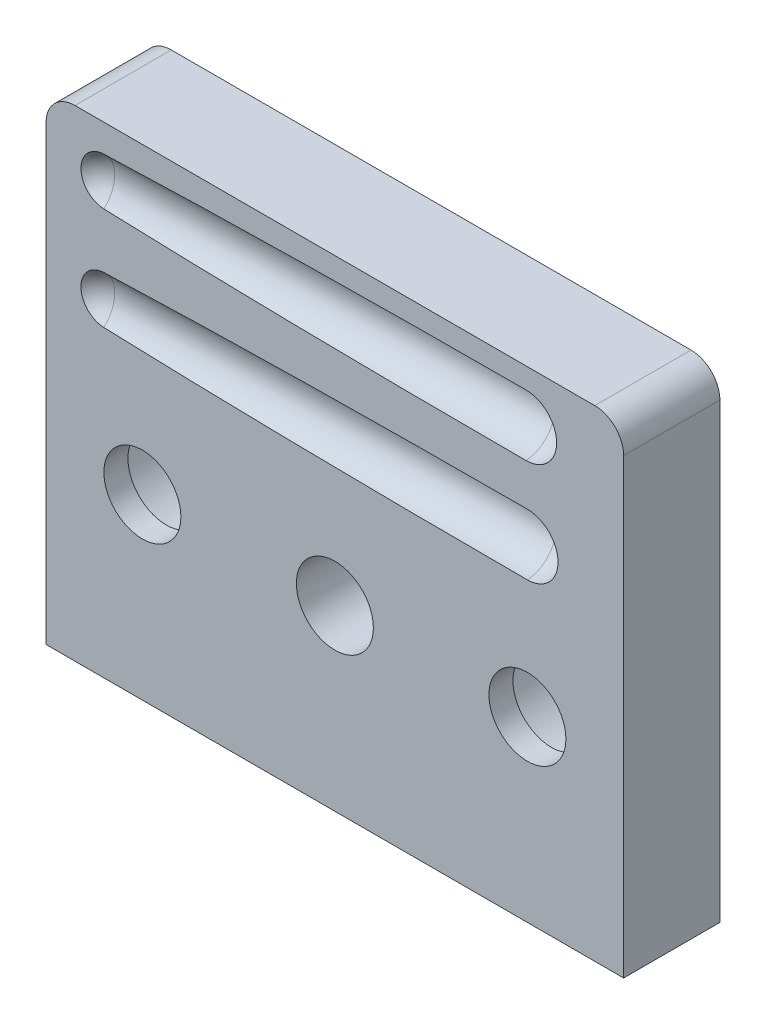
ISO-10303-21;
HEADER;
FILE_DESCRIPTION(('STEP AP214'),'2;1');
FILE_NAME('part.step','',(''),(''),'','','');
FILE_SCHEMA(('AUTOMOTIVE_DESIGN { 1 0 10303 214 1 1 1 1 }'));
ENDSEC;
DATA;
#1=APPLICATION_CONTEXT('core data for automotive mechanical design processes');
#2=APPLICATION_PROTOCOL_DEFINITION('international standard','automotive_design',2000,#1);
#3=PRODUCT_CONTEXT('',#1,'mechanical');
#4=PRODUCT('Part','Part','',(#3));
#5=PRODUCT_RELATED_PRODUCT_CATEGORY('part','',(#4));
#6=PRODUCT_DEFINITION_FORMATION('','',#4);
#7=PRODUCT_DEFINITION_CONTEXT('part definition',#1,'design');
#8=PRODUCT_DEFINITION('design','',#6,#7);
#9=PRODUCT_DEFINITION_SHAPE('','',#8);
#10=(LENGTH_UNIT() NAMED_UNIT(*) SI_UNIT(.MILLI.,.METRE.));
#11=(NAMED_UNIT(*) PLANE_ANGLE_UNIT() SI_UNIT($,.RADIAN.));
#12=(NAMED_UNIT(*) SI_UNIT($,.STERADIAN.) SOLID_ANGLE_UNIT());
#13=UNCERTAINTY_MEASURE_WITH_UNIT(LENGTH_MEASURE(1.E-05),#10,'distance_accuracy_value','');
#14=(GEOMETRIC_REPRESENTATION_CONTEXT(3) GLOBAL_UNCERTAINTY_ASSIGNED_CONTEXT((#13)) GLOBAL_UNIT_ASSIGNED_CONTEXT((#10,
#11,#12)) REPRESENTATION_CONTEXT('',''));
#15=CARTESIAN_POINT('',(0.,0.,0.));
#16=DIRECTION('',(0.,0.,1.));
#17=DIRECTION('',(1.,0.,0.));
#18=AXIS2_PLACEMENT_3D('',#15,#16,#17);
#19=CARTESIAN_POINT('',(0.,0.,0.));
#20=DIRECTION('',(0.,0.,1.));
#21=DIRECTION('',(1.,0.,0.));
#22=AXIS2_PLACEMENT_3D('',#19,#20,#21);
#23=CYLINDRICAL_SURFACE('',#22,4.);
#24=CARTESIAN_POINT('',(0.,0.,10.));
#25=DIRECTION('',(0.,0.,1.));
#26=DIRECTION('',(1.,0.,0.));
#27=AXIS2_PLACEMENT_3D('',#24,#25,#26);
#28=CIRCLE('',#27,4.);
#29=CARTESIAN_POINT('',(4.00000000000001,0.,10.));
#30=VERTEX_POINT('',#29);
#31=EDGE_CURVE('E154',#30,#30,#28,.T.);
#32=ORIENTED_EDGE('',*,*,#31,.T.);
#33=EDGE_LOOP('',(#32));
#34=FACE_BOUND('',#33,.T.);
#35=CARTESIAN_POINT('',(0.,0.,4.));
#36=DIRECTION('',(0.,0.,-1.));
#37=DIRECTION('',(-1.,0.,0.));
#38=AXIS2_PLACEMENT_3D('',#35,#36,#37);
#39=CIRCLE('',#38,4.);
#40=CARTESIAN_POINT('',(-3.99999999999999,0.,4.));
#41=VERTEX_POINT('',#40);
#42=EDGE_CURVE('E33',#41,#41,#39,.F.);
#43=ORIENTED_EDGE('',*,*,#42,.F.);
#44=EDGE_LOOP('',(#43));
#45=FACE_BOUND('',#44,.T.);
#46=ADVANCED_FACE('F29',(#34,#45),#23,.F.);
#47=CARTESIAN_POINT('',(-20.,0.,0.));
#48=DIRECTION('',(0.,0.,1.));
#49=DIRECTION('',(1.,0.,0.));
#50=AXIS2_PLACEMENT_3D('',#47,#48,#49);
#51=CYLINDRICAL_SURFACE('',#50,4.);
#52=CARTESIAN_POINT('',(-20.,0.,10.));
#53=DIRECTION('',(0.,0.,1.));
#54=DIRECTION('',(1.,0.,0.));
#55=AXIS2_PLACEMENT_3D('',#52,#53,#54);
#56=CIRCLE('',#55,4.);
#57=CARTESIAN_POINT('',(-16.,0.,10.));
#58=VERTEX_POINT('',#57);
#59=EDGE_CURVE('E157',#58,#58,#56,.T.);
#60=ORIENTED_EDGE('',*,*,#59,.T.);
#61=EDGE_LOOP('',(#60));
#62=FACE_BOUND('',#61,.T.);
#63=CARTESIAN_POINT('',(-20.,0.,7.5));
#64=DIRECTION('',(0.,0.,-1.));
#65=DIRECTION('',(-1.,0.,0.));
#66=AXIS2_PLACEMENT_3D('',#63,#64,#65);
#67=CIRCLE('',#66,4.);
#68=CARTESIAN_POINT('',(-24.,0.,7.5));
#69=VERTEX_POINT('',#68);
#70=EDGE_CURVE('E127',#69,#69,#67,.F.);
#71=ORIENTED_EDGE('',*,*,#70,.F.);
#72=EDGE_LOOP('',(#71));
#73=FACE_BOUND('',#72,.T.);
#74=ADVANCED_FACE('F235',(#62,#73),#51,.F.);
#75=CARTESIAN_POINT('',(20.,0.,0.));
#76=DIRECTION('',(0.,0.,1.));
#77=DIRECTION('',(1.,0.,0.));
#78=AXIS2_PLACEMENT_3D('',#75,#76,#77);
#79=CYLINDRICAL_SURFACE('',#78,4.);
#80=CARTESIAN_POINT('',(20.,0.,10.));
#81=DIRECTION('',(0.,0.,1.));
#82=DIRECTION('',(1.,0.,0.));
#83=AXIS2_PLACEMENT_3D('',#80,#81,#82);
#84=CIRCLE('',#83,4.);
#85=CARTESIAN_POINT('',(24.,0.,10.));
#86=VERTEX_POINT('',#85);
#87=EDGE_CURVE('E151',#86,#86,#84,.T.);
#88=ORIENTED_EDGE('',*,*,#87,.T.);
#89=EDGE_LOOP('',(#88));
#90=FACE_BOUND('',#89,.T.);
#91=CARTESIAN_POINT('',(20.,0.,7.5));
#92=DIRECTION('',(0.,0.,-1.));
#93=DIRECTION('',(-1.,0.,0.));
#94=AXIS2_PLACEMENT_3D('',#91,#92,#93);
#95=CIRCLE('',#94,4.);
#96=CARTESIAN_POINT('',(16.,0.,7.5));
#97=VERTEX_POINT('',#96);
#98=EDGE_CURVE('E124',#97,#97,#95,.F.);
#99=ORIENTED_EDGE('',*,*,#98,.F.);
#100=EDGE_LOOP('',(#99));
#101=FACE_BOUND('',#100,.T.);
#102=ADVANCED_FACE('F241',(#90,#101),#79,.F.);
#103=CARTESIAN_POINT('',(-30.,-18.5,10.));
#104=DIRECTION('',(0.,0.,-1.));
#105=DIRECTION('',(-1.,0.,0.));
#106=AXIS2_PLACEMENT_3D('',#103,#104,#105);
#107=PLANE('',#106);
#108=CARTESIAN_POINT('',(-23.9094567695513,15.5,10.));
#109=DIRECTION('',(0.,0.,-1.));
#110=DIRECTION('',(-1.,0.,0.));
#111=AXIS2_PLACEMENT_3D('',#108,#109,#110);
#112=CIRCLE('',#111,2.47723554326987);
#113=CARTESIAN_POINT('',(-24.,17.9755803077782,10.));
#114=VERTEX_POINT('',#113);
#115=CARTESIAN_POINT('',(-24.,13.0244196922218,10.));
#116=VERTEX_POINT('',#115);
#117=EDGE_CURVE('E38',#114,#116,#112,.F.);
#118=ORIENTED_EDGE('',*,*,#117,.F.);
#119=CARTESIAN_POINT('',(20.,15.5,10.));
#120=DIRECTION('',(0.,0.,-1.));
#121=DIRECTION('',(-1.,0.,0.));
#122=AXIS2_PLACEMENT_3D('',#119,#120,#121);
#123=ELLIPSE('',#122,70.1012021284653,3.18);
#124=CARTESIAN_POINT('',(20.0000000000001,18.68,10.));
#125=VERTEX_POINT('',#124);
#126=EDGE_CURVE('E11',#114,#125,#123,.T.);
#127=ORIENTED_EDGE('',*,*,#126,.T.);
#128=CARTESIAN_POINT('',(20.,15.5000000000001,10.));
#129=DIRECTION('',(0.,0.,-1.));
#130=DIRECTION('',(-1.,0.,0.));
#131=AXIS2_PLACEMENT_3D('',#128,#129,#130);
#132=CIRCLE('',#131,3.18000000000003);
#133=CARTESIAN_POINT('',(20.,12.32,10.));
#134=VERTEX_POINT('',#133);
#135=EDGE_CURVE('E109',#125,#134,#132,.T.);
#136=ORIENTED_EDGE('',*,*,#135,.T.);
#137=EDGE_CURVE('E40',#134,#116,#123,.T.);
#138=ORIENTED_EDGE('',*,*,#137,.T.);
#139=EDGE_LOOP('',(#118,#127,#136,#138));
#140=FACE_BOUND('',#139,.T.);
#141=DIRECTION('',(-1.,0.,0.));
#142=VECTOR('',#141,1.);
#143=CARTESIAN_POINT('',(30.,31.5,10.));
#144=LINE('',#143,#142);
#145=CARTESIAN_POINT('',(27.,31.5,10.));
#146=VERTEX_POINT('',#145);
#147=CARTESIAN_POINT('',(-27.,31.5,10.));
#148=VERTEX_POINT('',#147);
#149=EDGE_CURVE('E174',#146,#148,#144,.T.);
#150=ORIENTED_EDGE('',*,*,#149,.T.);
#151=CARTESIAN_POINT('',(-27.,28.5,10.));
#152=DIRECTION('',(0.,0.,-1.));
#153=DIRECTION('',(-1.,0.,0.));
#154=AXIS2_PLACEMENT_3D('',#151,#152,#153);
#155=CIRCLE('',#154,3.);
#156=CARTESIAN_POINT('',(-30.,28.5,10.));
#157=VERTEX_POINT('',#156);
#158=EDGE_CURVE('E201',#148,#157,#155,.F.);
#159=ORIENTED_EDGE('',*,*,#158,.T.);
#160=DIRECTION('',(0.,1.,0.));
#161=VECTOR('',#160,1.);
#162=CARTESIAN_POINT('',(-30.,-18.5,10.));
#163=LINE('',#162,#161);
#164=CARTESIAN_POINT('',(-30.,-18.5,10.));
#165=VERTEX_POINT('',#164);
#166=EDGE_CURVE('E171',#165,#157,#163,.T.);
#167=ORIENTED_EDGE('',*,*,#166,.F.);
#168=DIRECTION('',(1.,0.,0.));
#169=VECTOR('',#168,1.);
#170=CARTESIAN_POINT('',(-30.,-18.5,10.));
#171=LINE('',#170,#169);
#172=CARTESIAN_POINT('',(30.,-18.5,10.));
#173=VERTEX_POINT('',#172);
#174=EDGE_CURVE('E179',#165,#173,#171,.T.);
#175=ORIENTED_EDGE('',*,*,#174,.T.);
#176=DIRECTION('',(0.,-1.,0.));
#177=VECTOR('',#176,1.);
#178=CARTESIAN_POINT('',(30.,31.5,10.));
#179=LINE('',#178,#177);
#180=CARTESIAN_POINT('',(30.,28.5,10.));
#181=VERTEX_POINT('',#180);
#182=EDGE_CURVE('E177',#181,#173,#179,.T.);
#183=ORIENTED_EDGE('',*,*,#182,.F.);
#184=CARTESIAN_POINT('',(27.,28.5,10.));
#185=DIRECTION('',(0.,0.,-1.));
#186=DIRECTION('',(-1.,0.,0.));
#187=AXIS2_PLACEMENT_3D('',#184,#185,#186);
#188=CIRCLE('',#187,3.);
#189=EDGE_CURVE('E199',#181,#146,#188,.F.);
#190=ORIENTED_EDGE('',*,*,#189,.T.);
#191=EDGE_LOOP('',(#150,#159,#167,#175,#183,#190));
#192=FACE_BOUND('',#191,.T.);
#193=ORIENTED_EDGE('',*,*,#59,.F.);
#194=EDGE_LOOP('',(#193));
#195=FACE_BOUND('',#194,.T.);
#196=ORIENTED_EDGE('',*,*,#31,.F.);
#197=EDGE_LOOP('',(#196));
#198=FACE_BOUND('',#197,.T.);
#199=ORIENTED_EDGE('',*,*,#87,.F.);
#200=EDGE_LOOP('',(#199));
#201=FACE_BOUND('',#200,.T.);
#202=CARTESIAN_POINT('',(-23.9094567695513,26.1607408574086,10.));
#203=DIRECTION('',(0.,0.,-1.));
#204=DIRECTION('',(-1.,0.,0.));
#205=AXIS2_PLACEMENT_3D('',#202,#203,#204);
#206=CIRCLE('',#205,2.47081382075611);
#207=CARTESIAN_POINT('',(-24.,28.6298951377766,10.));
#208=VERTEX_POINT('',#207);
#209=CARTESIAN_POINT('',(-24.,23.6915865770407,10.));
#210=VERTEX_POINT('',#209);
#211=EDGE_CURVE('E212',#208,#210,#206,.F.);
#212=ORIENTED_EDGE('',*,*,#211,.F.);
#213=CARTESIAN_POINT('',(20.,26.1607408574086,10.));
#214=DIRECTION('',(0.,0.,-1.));
#215=DIRECTION('',(-1.,0.,0.));
#216=AXIS2_PLACEMENT_3D('',#213,#214,#215);
#217=ELLIPSE('',#216,69.9909801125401,3.175);
#218=CARTESIAN_POINT('',(19.8611442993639,29.3357346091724,10.));
#219=VERTEX_POINT('',#218);
#220=EDGE_CURVE('E211',#208,#219,#217,.T.);
#221=ORIENTED_EDGE('',*,*,#220,.T.);
#222=CARTESIAN_POINT('',(19.8614300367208,26.1607408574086,10.));
#223=DIRECTION('',(0.,0.,-1.));
#224=DIRECTION('',(-1.,0.,0.));
#225=AXIS2_PLACEMENT_3D('',#222,#223,#224);
#226=CIRCLE('',#225,3.17499376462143);
#227=CARTESIAN_POINT('',(19.8611442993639,22.9857471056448,10.));
#228=VERTEX_POINT('',#227);
#229=EDGE_CURVE('E205',#219,#228,#226,.T.);
#230=ORIENTED_EDGE('',*,*,#229,.T.);
#231=EDGE_CURVE('E208',#228,#210,#217,.T.);
#232=ORIENTED_EDGE('',*,*,#231,.T.);
#233=EDGE_LOOP('',(#212,#221,#230,#232));
#234=FACE_BOUND('',#233,.T.);
#235=ADVANCED_FACE('F119',(#140,#192,#195,#198,#201,#234),#107,.F.);
#236=CARTESIAN_POINT('',(-30.,-18.5,10.));
#237=DIRECTION('',(-1.,0.,0.));
#238=DIRECTION('',(0.,0.,1.));
#239=AXIS2_PLACEMENT_3D('',#236,#237,#238);
#240=PLANE('',#239);
#241=ORIENTED_EDGE('',*,*,#166,.T.);
#242=DIRECTION('',(0.,0.,-1.));
#243=VECTOR('',#242,1.);
#244=CARTESIAN_POINT('',(-30.,28.5,10.));
#245=LINE('',#244,#243);
#246=CARTESIAN_POINT('',(-30.,28.5,0.));
#247=VERTEX_POINT('',#246);
#248=EDGE_CURVE('E187',#157,#247,#245,.T.);
#249=ORIENTED_EDGE('',*,*,#248,.T.);
#250=DIRECTION('',(0.,1.,0.));
#251=VECTOR('',#250,1.);
#252=CARTESIAN_POINT('',(-30.,-18.5,0.));
#253=LINE('',#252,#251);
#254=CARTESIAN_POINT('',(-30.,-18.5,0.));
#255=VERTEX_POINT('',#254);
#256=EDGE_CURVE('E160',#255,#247,#253,.T.);
#257=ORIENTED_EDGE('',*,*,#256,.F.);
#258=DIRECTION('',(0.,0.,-1.));
#259=VECTOR('',#258,1.);
#260=CARTESIAN_POINT('',(-30.,-18.5,10.));
#261=LINE('',#260,#259);
#262=EDGE_CURVE('E185',#165,#255,#261,.T.);
#263=ORIENTED_EDGE('',*,*,#262,.F.);
#264=EDGE_LOOP('',(#241,#249,#257,#263));
#265=FACE_BOUND('',#264,.T.);
#266=ADVANCED_FACE('F256',(#265),#240,.T.);
#267=CARTESIAN_POINT('',(-30.,-18.5,10.));
#268=DIRECTION('',(0.,1.,0.));
#269=DIRECTION('',(0.,0.,1.));
#270=AXIS2_PLACEMENT_3D('',#267,#268,#269);
#271=PLANE('',#270);
#272=DIRECTION('',(0.,0.,-1.));
#273=VECTOR('',#272,1.);
#274=CARTESIAN_POINT('',(30.,-18.5,10.));
#275=LINE('',#274,#273);
#276=CARTESIAN_POINT('',(30.,-18.5,0.));
#277=VERTEX_POINT('',#276);
#278=EDGE_CURVE('E182',#173,#277,#275,.T.);
#279=ORIENTED_EDGE('',*,*,#278,.F.);
#280=ORIENTED_EDGE('',*,*,#174,.F.);
#281=ORIENTED_EDGE('',*,*,#262,.T.);
#282=DIRECTION('',(1.,0.,0.));
#283=VECTOR('',#282,1.);
#284=CARTESIAN_POINT('',(-30.,-18.5,0.));
#285=LINE('',#284,#283);
#286=EDGE_CURVE('E168',#255,#277,#285,.T.);
#287=ORIENTED_EDGE('',*,*,#286,.T.);
#288=EDGE_LOOP('',(#279,#280,#281,#287));
#289=FACE_BOUND('',#288,.T.);
#290=ADVANCED_FACE('F31',(#289),#271,.F.);
#291=CARTESIAN_POINT('',(30.,31.5,10.));
#292=DIRECTION('',(1.,0.,0.));
#293=DIRECTION('',(0.,0.,-1.));
#294=AXIS2_PLACEMENT_3D('',#291,#292,#293);
#295=PLANE('',#294);
#296=DIRECTION('',(0.,-1.,0.));
#297=VECTOR('',#296,1.);
#298=CARTESIAN_POINT('',(30.,31.5,0.));
#299=LINE('',#298,#297);
#300=CARTESIAN_POINT('',(30.,28.5,0.));
#301=VERTEX_POINT('',#300);
#302=EDGE_CURVE('E166',#301,#277,#299,.T.);
#303=ORIENTED_EDGE('',*,*,#302,.F.);
#304=DIRECTION('',(0.,0.,-1.));
#305=VECTOR('',#304,1.);
#306=CARTESIAN_POINT('',(30.,28.5,10.));
#307=LINE('',#306,#305);
#308=EDGE_CURVE('E203',#301,#181,#307,.F.);
#309=ORIENTED_EDGE('',*,*,#308,.T.);
#310=ORIENTED_EDGE('',*,*,#182,.T.);
#311=ORIENTED_EDGE('',*,*,#278,.T.);
#312=EDGE_LOOP('',(#303,#309,#310,#311));
#313=FACE_BOUND('',#312,.T.);
#314=ADVANCED_FACE('F261',(#313),#295,.T.);
#315=CARTESIAN_POINT('',(30.,31.5,10.));
#316=DIRECTION('',(0.,-1.,0.));
#317=DIRECTION('',(1.,0.,0.));
#318=AXIS2_PLACEMENT_3D('',#315,#316,#317);
#319=PLANE('',#318);
#320=DIRECTION('',(-1.,0.,0.));
#321=VECTOR('',#320,1.);
#322=CARTESIAN_POINT('',(30.,31.5,0.));
#323=LINE('',#322,#321);
#324=CARTESIAN_POINT('',(27.,31.5,0.));
#325=VERTEX_POINT('',#324);
#326=CARTESIAN_POINT('',(-27.,31.5,0.));
#327=VERTEX_POINT('',#326);
#328=EDGE_CURVE('E163',#325,#327,#323,.T.);
#329=ORIENTED_EDGE('',*,*,#328,.T.);
#330=DIRECTION('',(0.,0.,-1.));
#331=VECTOR('',#330,1.);
#332=CARTESIAN_POINT('',(-27.,31.5,10.));
#333=LINE('',#332,#331);
#334=EDGE_CURVE('E197',#327,#148,#333,.F.);
#335=ORIENTED_EDGE('',*,*,#334,.T.);
#336=ORIENTED_EDGE('',*,*,#149,.F.);
#337=DIRECTION('',(0.,0.,-1.));
#338=VECTOR('',#337,1.);
#339=CARTESIAN_POINT('',(27.,31.5,10.));
#340=LINE('',#339,#338);
#341=EDGE_CURVE('E194',#146,#325,#340,.T.);
#342=ORIENTED_EDGE('',*,*,#341,.T.);
#343=EDGE_LOOP('',(#329,#335,#336,#342));
#344=FACE_BOUND('',#343,.T.);
#345=ADVANCED_FACE('F252',(#344),#319,.F.);
#346=CARTESIAN_POINT('',(-30.,-18.5,0.));
#347=DIRECTION('',(0.,0.,-1.));
#348=DIRECTION('',(-1.,0.,0.));
#349=AXIS2_PLACEMENT_3D('',#346,#347,#348);
#350=PLANE('',#349);
#351=CARTESIAN_POINT('',(0.,0.,0.));
#352=DIRECTION('',(0.,0.,-1.));
#353=DIRECTION('',(-1.,0.,0.));
#354=AXIS2_PLACEMENT_3D('',#351,#352,#353);
#355=CIRCLE('',#354,6.75);
#356=CARTESIAN_POINT('',(-6.74999999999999,0.,0.));
#357=VERTEX_POINT('',#356);
#358=EDGE_CURVE('E393',#357,#357,#355,.T.);
#359=ORIENTED_EDGE('',*,*,#358,.F.);
#360=EDGE_LOOP('',(#359));
#361=FACE_BOUND('',#360,.T.);
#362=CARTESIAN_POINT('',(-20.,0.,0.));
#363=DIRECTION('',(0.,0.,-1.));
#364=DIRECTION('',(-1.,0.,0.));
#365=AXIS2_PLACEMENT_3D('',#362,#363,#364);
#366=CIRCLE('',#365,6.75);
#367=CARTESIAN_POINT('',(-26.75,0.,0.));
#368=VERTEX_POINT('',#367);
#369=EDGE_CURVE('E136',#368,#368,#366,.T.);
#370=ORIENTED_EDGE('',*,*,#369,.F.);
#371=EDGE_LOOP('',(#370));
#372=FACE_BOUND('',#371,.T.);
#373=CARTESIAN_POINT('',(20.,0.,0.));
#374=DIRECTION('',(0.,0.,-1.));
#375=DIRECTION('',(-1.,0.,0.));
#376=AXIS2_PLACEMENT_3D('',#373,#374,#375);
#377=CIRCLE('',#376,6.75);
#378=CARTESIAN_POINT('',(13.25,0.,0.));
#379=VERTEX_POINT('',#378);
#380=EDGE_CURVE('E129',#379,#379,#377,.T.);
#381=ORIENTED_EDGE('',*,*,#380,.F.);
#382=EDGE_LOOP('',(#381));
#383=FACE_BOUND('',#382,.T.);
#384=ORIENTED_EDGE('',*,*,#256,.T.);
#385=CARTESIAN_POINT('',(-27.,28.5,0.));
#386=DIRECTION('',(0.,0.,-1.));
#387=DIRECTION('',(-1.,0.,0.));
#388=AXIS2_PLACEMENT_3D('',#385,#386,#387);
#389=CIRCLE('',#388,3.);
#390=EDGE_CURVE('E192',#247,#327,#389,.T.);
#391=ORIENTED_EDGE('',*,*,#390,.T.);
#392=ORIENTED_EDGE('',*,*,#328,.F.);
#393=CARTESIAN_POINT('',(27.,28.5,0.));
#394=DIRECTION('',(0.,0.,-1.));
#395=DIRECTION('',(-1.,0.,0.));
#396=AXIS2_PLACEMENT_3D('',#393,#394,#395);
#397=CIRCLE('',#396,3.);
#398=EDGE_CURVE('E190',#325,#301,#397,.T.);
#399=ORIENTED_EDGE('',*,*,#398,.T.);
#400=ORIENTED_EDGE('',*,*,#302,.T.);
#401=ORIENTED_EDGE('',*,*,#286,.F.);
#402=EDGE_LOOP('',(#384,#391,#392,#399,#400,#401));
#403=FACE_BOUND('',#402,.T.);
#404=ADVANCED_FACE('F248',(#361,#372,#383,#403),#350,.T.);
#405=CARTESIAN_POINT('',(-27.,28.5,10.));
#406=DIRECTION('',(0.,0.,1.));
#407=DIRECTION('',(1.,0.,0.));
#408=AXIS2_PLACEMENT_3D('',#405,#406,#407);
#409=CYLINDRICAL_SURFACE('',#408,3.);
#410=ORIENTED_EDGE('',*,*,#158,.F.);
#411=ORIENTED_EDGE('',*,*,#334,.F.);
#412=ORIENTED_EDGE('',*,*,#390,.F.);
#413=ORIENTED_EDGE('',*,*,#248,.F.);
#414=EDGE_LOOP('',(#410,#411,#412,#413));
#415=FACE_BOUND('',#414,.T.);
#416=ADVANCED_FACE('F230',(#415),#409,.T.);
#417=CARTESIAN_POINT('',(27.,28.5,10.));
#418=DIRECTION('',(0.,0.,1.));
#419=DIRECTION('',(1.,0.,0.));
#420=AXIS2_PLACEMENT_3D('',#417,#418,#419);
#421=CYLINDRICAL_SURFACE('',#420,3.);
#422=ORIENTED_EDGE('',*,*,#189,.F.);
#423=ORIENTED_EDGE('',*,*,#308,.F.);
#424=ORIENTED_EDGE('',*,*,#398,.F.);
#425=ORIENTED_EDGE('',*,*,#341,.F.);
#426=EDGE_LOOP('',(#422,#423,#424,#425));
#427=FACE_BOUND('',#426,.T.);
#428=ADVANCED_FACE('F222',(#427),#421,.T.);
#429=CARTESIAN_POINT('',(-23.9094567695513,26.1607408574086,11.9939167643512));
#430=DIRECTION('',(0.,0.,1.));
#431=DIRECTION('',(1.,0.,0.));
#432=AXIS2_PLACEMENT_3D('',#429,#430,#431);
#433=SPHERICAL_SURFACE('',#432,3.17500000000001);
#434=ORIENTED_EDGE('',*,*,#211,.T.);
#435=CARTESIAN_POINT('',(-23.9094567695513,26.1607408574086,11.9939167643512));
#436=DIRECTION('',(-0.998970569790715,0.,0.0453629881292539));
#437=DIRECTION('',(0.0453629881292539,0.,0.998970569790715));
#438=AXIS2_PLACEMENT_3D('',#435,#436,#437);
#439=CIRCLE('',#438,3.175);
#440=EDGE_CURVE('E148',#208,#210,#439,.T.);
#441=ORIENTED_EDGE('',*,*,#440,.F.);
#442=EDGE_LOOP('',(#434,#441));
#443=FACE_BOUND('',#442,.T.);
#444=ADVANCED_FACE('F220',(#443),#433,.F.);
#445=CARTESIAN_POINT('',(-32.4717098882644,26.1607408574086,12.382726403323));
#446=DIRECTION('',(-0.998970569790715,0.,0.0453629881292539));
#447=DIRECTION('',(0.0453629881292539,0.,0.998970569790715));
#448=AXIS2_PLACEMENT_3D('',#445,#446,#447);
#449=CYLINDRICAL_SURFACE('',#448,3.175);
#450=ORIENTED_EDGE('',*,*,#440,.T.);
#451=ORIENTED_EDGE('',*,*,#231,.F.);
#452=CARTESIAN_POINT('',(19.8614300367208,26.1607408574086,10.0062924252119));
#453=DIRECTION('',(-0.998970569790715,0.,0.0453629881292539));
#454=DIRECTION('',(0.0453629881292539,0.,0.998970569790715));
#455=AXIS2_PLACEMENT_3D('',#452,#453,#454);
#456=CIRCLE('',#455,3.175);
#457=EDGE_CURVE('E54',#219,#228,#456,.T.);
#458=ORIENTED_EDGE('',*,*,#457,.F.);
#459=ORIENTED_EDGE('',*,*,#220,.F.);
#460=EDGE_LOOP('',(#450,#451,#458,#459));
#461=FACE_BOUND('',#460,.T.);
#462=ADVANCED_FACE('F219',(#461),#449,.F.);
#463=CARTESIAN_POINT('',(19.8614300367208,26.1607408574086,10.0062924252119));
#464=DIRECTION('',(0.,0.,1.));
#465=DIRECTION('',(1.,0.,0.));
#466=AXIS2_PLACEMENT_3D('',#463,#464,#465);
#467=SPHERICAL_SURFACE('',#466,3.175);
#468=ORIENTED_EDGE('',*,*,#457,.T.);
#469=ORIENTED_EDGE('',*,*,#229,.F.);
#470=EDGE_LOOP('',(#468,#469));
#471=FACE_BOUND('',#470,.T.);
#472=ADVANCED_FACE('F228',(#471),#467,.F.);
#473=CARTESIAN_POINT('',(-23.9094567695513,15.5,11.9939167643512));
#474=DIRECTION('',(0.,0.,1.));
#475=DIRECTION('',(1.,0.,0.));
#476=AXIS2_PLACEMENT_3D('',#473,#474,#475);
#477=SPHERICAL_SURFACE('',#476,3.18000000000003);
#478=ORIENTED_EDGE('',*,*,#117,.T.);
#479=CARTESIAN_POINT('',(-23.9094567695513,15.5,11.9939167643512));
#480=DIRECTION('',(-0.998970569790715,0.,0.0453629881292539));
#481=DIRECTION('',(0.0453629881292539,0.,0.998970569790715));
#482=AXIS2_PLACEMENT_3D('',#479,#480,#481);
#483=CIRCLE('',#482,3.18);
#484=EDGE_CURVE('E47',#114,#116,#483,.T.);
#485=ORIENTED_EDGE('',*,*,#484,.F.);
#486=EDGE_LOOP('',(#478,#485));
#487=FACE_BOUND('',#486,.T.);
#488=ADVANCED_FACE('F315',(#487),#477,.F.);
#489=CARTESIAN_POINT('',(20.,15.5000000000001,10.));
#490=DIRECTION('',(0.,0.,1.));
#491=DIRECTION('',(1.,0.,0.));
#492=AXIS2_PLACEMENT_3D('',#489,#490,#491);
#493=SPHERICAL_SURFACE('',#492,3.18000000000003);
#494=CARTESIAN_POINT('',(20.0000000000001,15.5,10.));
#495=DIRECTION('',(-0.998970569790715,0.,0.0453629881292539));
#496=DIRECTION('',(0.0453629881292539,0.,0.998970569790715));
#497=AXIS2_PLACEMENT_3D('',#494,#495,#496);
#498=CIRCLE('',#497,3.18);
#499=EDGE_CURVE('E112',#125,#134,#498,.T.);
#500=ORIENTED_EDGE('',*,*,#499,.T.);
#501=ORIENTED_EDGE('',*,*,#135,.F.);
#502=EDGE_LOOP('',(#500,#501));
#503=FACE_BOUND('',#502,.T.);
#504=ADVANCED_FACE('F111',(#503),#493,.F.);
#505=CARTESIAN_POINT('',(-33.4706804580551,15.5,12.4280893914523));
#506=DIRECTION('',(-0.998970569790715,0.,0.0453629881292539));
#507=DIRECTION('',(0.0453629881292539,0.,0.998970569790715));
#508=AXIS2_PLACEMENT_3D('',#505,#506,#507);
#509=CYLINDRICAL_SURFACE('',#508,3.18);
#510=ORIENTED_EDGE('',*,*,#484,.T.);
#511=ORIENTED_EDGE('',*,*,#137,.F.);
#512=ORIENTED_EDGE('',*,*,#499,.F.);
#513=ORIENTED_EDGE('',*,*,#126,.F.);
#514=EDGE_LOOP('',(#510,#511,#512,#513));
#515=FACE_BOUND('',#514,.T.);
#516=ADVANCED_FACE('F116',(#515),#509,.F.);
#517=CARTESIAN_POINT('',(20.,0.,7.5));
#518=DIRECTION('',(0.,0.,-1.));
#519=DIRECTION('',(-1.,0.,0.));
#520=AXIS2_PLACEMENT_3D('',#517,#518,#519);
#521=PLANE('',#520);
#522=CARTESIAN_POINT('',(20.,0.,7.5));
#523=DIRECTION('',(0.,0.,-1.));
#524=DIRECTION('',(-1.,0.,0.));
#525=AXIS2_PLACEMENT_3D('',#522,#523,#524);
#526=CIRCLE('',#525,6.75);
#527=CARTESIAN_POINT('',(13.25,0.,7.5));
#528=VERTEX_POINT('',#527);
#529=EDGE_CURVE('E126',#528,#528,#526,.T.);
#530=ORIENTED_EDGE('',*,*,#529,.T.);
#531=EDGE_LOOP('',(#530));
#532=FACE_BOUND('',#531,.T.);
#533=ORIENTED_EDGE('',*,*,#98,.T.);
#534=EDGE_LOOP('',(#533));
#535=FACE_BOUND('',#534,.T.);
#536=ADVANCED_FACE('F296',(#532,#535),#521,.T.);
#537=CARTESIAN_POINT('',(20.,0.,7.5));
#538=DIRECTION('',(0.,0.,-1.));
#539=DIRECTION('',(-1.,0.,0.));
#540=AXIS2_PLACEMENT_3D('',#537,#538,#539);
#541=CYLINDRICAL_SURFACE('',#540,6.75);
#542=ORIENTED_EDGE('',*,*,#529,.F.);
#543=EDGE_LOOP('',(#542));
#544=FACE_BOUND('',#543,.T.);
#545=ORIENTED_EDGE('',*,*,#380,.T.);
#546=EDGE_LOOP('',(#545));
#547=FACE_BOUND('',#546,.T.);
#548=ADVANCED_FACE('F298',(#544,#547),#541,.F.);
#549=CARTESIAN_POINT('',(-20.,0.,7.5));
#550=DIRECTION('',(0.,0.,-1.));
#551=DIRECTION('',(-1.,0.,0.));
#552=AXIS2_PLACEMENT_3D('',#549,#550,#551);
#553=PLANE('',#552);
#554=CARTESIAN_POINT('',(-20.,0.,7.5));
#555=DIRECTION('',(0.,0.,-1.));
#556=DIRECTION('',(-1.,0.,0.));
#557=AXIS2_PLACEMENT_3D('',#554,#555,#556);
#558=CIRCLE('',#557,6.75);
#559=CARTESIAN_POINT('',(-26.75,0.,7.5));
#560=VERTEX_POINT('',#559);
#561=EDGE_CURVE('E130',#560,#560,#558,.T.);
#562=ORIENTED_EDGE('',*,*,#561,.T.);
#563=EDGE_LOOP('',(#562));
#564=FACE_BOUND('',#563,.T.);
#565=ORIENTED_EDGE('',*,*,#70,.T.);
#566=EDGE_LOOP('',(#565));
#567=FACE_BOUND('',#566,.T.);
#568=ADVANCED_FACE('F305',(#564,#567),#553,.T.);
#569=CARTESIAN_POINT('',(-20.,0.,7.5));
#570=DIRECTION('',(0.,0.,-1.));
#571=DIRECTION('',(-1.,0.,0.));
#572=AXIS2_PLACEMENT_3D('',#569,#570,#571);
#573=CYLINDRICAL_SURFACE('',#572,6.75);
#574=ORIENTED_EDGE('',*,*,#561,.F.);
#575=EDGE_LOOP('',(#574));
#576=FACE_BOUND('',#575,.T.);
#577=ORIENTED_EDGE('',*,*,#369,.T.);
#578=EDGE_LOOP('',(#577));
#579=FACE_BOUND('',#578,.T.);
#580=ADVANCED_FACE('F310',(#576,#579),#573,.F.);
#581=CARTESIAN_POINT('',(0.,0.,4.));
#582=DIRECTION('',(0.,0.,-1.));
#583=DIRECTION('',(-1.,0.,0.));
#584=AXIS2_PLACEMENT_3D('',#581,#582,#583);
#585=PLANE('',#584);
#586=CARTESIAN_POINT('',(0.,0.,4.));
#587=DIRECTION('',(0.,0.,-1.));
#588=DIRECTION('',(-1.,0.,0.));
#589=AXIS2_PLACEMENT_3D('',#586,#587,#588);
#590=CIRCLE('',#589,6.75);
#591=CARTESIAN_POINT('',(-6.74999999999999,0.,4.));
#592=VERTEX_POINT('',#591);
#593=EDGE_CURVE('E390',#592,#592,#590,.T.);
#594=ORIENTED_EDGE('',*,*,#593,.T.);
#595=EDGE_LOOP('',(#594));
#596=FACE_BOUND('',#595,.T.);
#597=ORIENTED_EDGE('',*,*,#42,.T.);
#598=EDGE_LOOP('',(#597));
#599=FACE_BOUND('',#598,.T.);
#600=ADVANCED_FACE('F363',(#596,#599),#585,.T.);
#601=CARTESIAN_POINT('',(0.,0.,4.));
#602=DIRECTION('',(0.,0.,-1.));
#603=DIRECTION('',(-1.,0.,0.));
#604=AXIS2_PLACEMENT_3D('',#601,#602,#603);
#605=CYLINDRICAL_SURFACE('',#604,6.75);
#606=ORIENTED_EDGE('',*,*,#593,.F.);
#607=EDGE_LOOP('',(#606));
#608=FACE_BOUND('',#607,.T.);
#609=ORIENTED_EDGE('',*,*,#358,.T.);
#610=EDGE_LOOP('',(#609));
#611=FACE_BOUND('',#610,.T.);
#612=ADVANCED_FACE('F373',(#608,#611),#605,.F.);
#613=CLOSED_SHELL('',(#46,#74,#102,#235,#266,#290,#314,#345,#404,#416,#428,#444,#462,#472,#488,
#504,#516,#536,#548,#568,#580,#600,#612));
#614=MANIFOLD_SOLID_BREP('B2',#613);
#615=ADVANCED_BREP_SHAPE_REPRESENTATION('',(#18,#614),#14);
#616=SHAPE_DEFINITION_REPRESENTATION(#9,#615);
ENDSEC;
END-ISO-10303-21;
